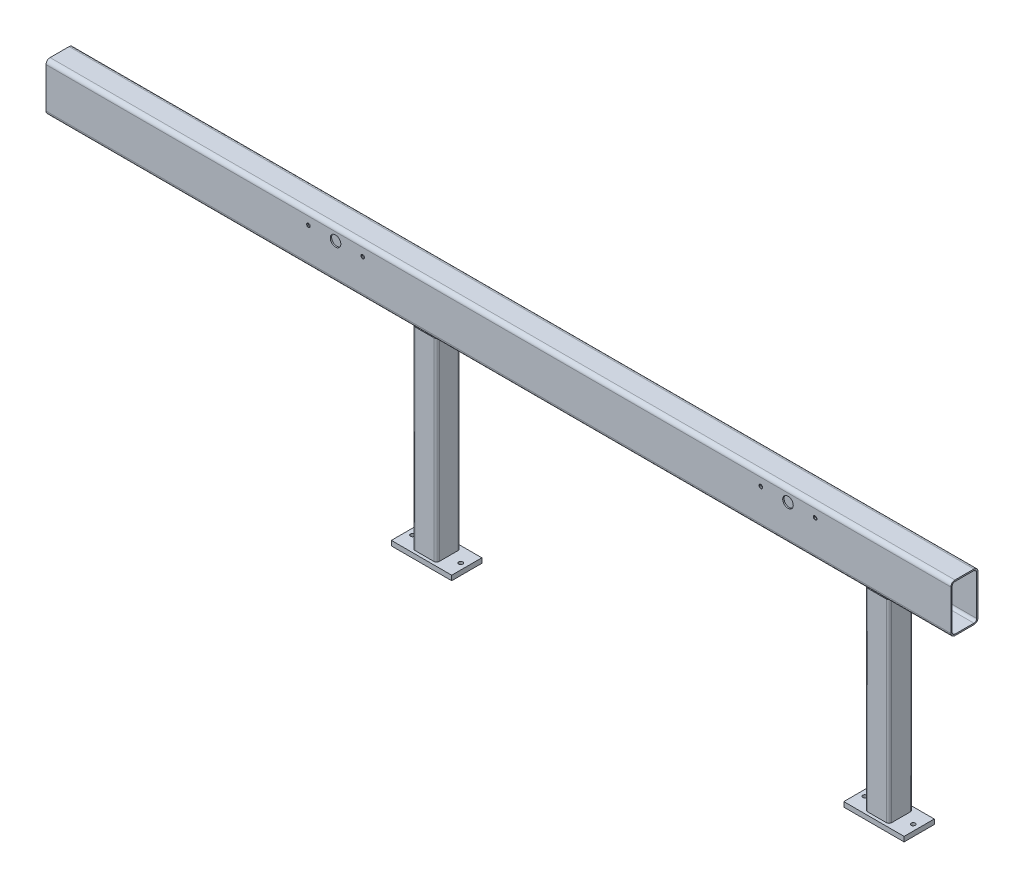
from build123d import *

# Parameters (mm, degrees)
STRUKTURBAUTEIL1_DEPTH                      = 3000
STRUKTURBAUTEIL2_DEPTH                      = 730
STRUKTURBAUTEIL2_2_DEPTH                    = 730
SKIZZE1571_W                                = 100
SKIZZE1571_H                                = 16
STRUKTURBAUTEIL3_DEPTH                      = 200
SKIZZE1571_ON_SEGMENT_2_W                   = 100
SKIZZE1571_ON_SEGMENT_2_H                   = 16
STRUKTURBAUTEIL3_2_DEPTH                    = 200
SKIZZE12_R                                  = 17.5
SCHNITT_LINEAR_AUSTRAGEN1_DEPTH             = 3091.901001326
M12_GEWINDEBOHRUNG1_AT_2_COUNT              = 2
M12_GEWINDEBOHRUNG1_AT_2_PITCH              = 180
SKIZZE145_W                                 = 6.75
SKIZZE145_H                                 = 16
F_13_5_13_5_DURCHMESSER_BOHRUNG1_AT_2_COUNT = 2
F_13_5_13_5_DURCHMESSER_BOHRUNG1_AT_2_PITCH = 160
LINEARES_MUSTER1_COUNT                      = 2
LINEARES_MUSTER1_PITCH                      = 1500
LINEARES_MUSTER1_COPY_2_SKETCH_W            = 6.75
LINEARES_MUSTER1_COPY_2_SKETCH_H            = 16


with BuildPart() as part:
    # Skizze155 → Strukturbauteil1 (new body)
    with BuildSketch(Plane(origin=(-3000, 0, 0), x_dir=(0, 0, 1), z_dir=(1, 0, 0))):
        with BuildLine():
            Line((-31.5, 80), (31.5, 80))
            ThreePointArc((31.5, 80), (41.045941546, 76.045941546), (45, 66.5))
            Line((45, 66.5), (45, -66.5))
            ThreePointArc((45, -66.5), (41.045941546, -76.045941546), (31.5, -80))
            Line((31.5, -80), (-31.5, -80))
            ThreePointArc((-31.5, -80), (-41.045941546, -76.045941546), (-45, -66.5))
            Line((-45, -66.5), (-45, 66.5))
            ThreePointArc((-45, 66.5), (-41.045941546, 76.045941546), (-31.5, 80))
        make_face()
        with BuildLine():
            Line((-31.5, 75.5), (31.5, 75.5))
            ThreePointArc((31.5, 75.5), (37.863961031, 72.863961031), (40.5, 66.5))
            Line((40.5, 66.5), (40.5, -66.5))
            ThreePointArc((40.5, -66.5), (37.863961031, -72.863961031), (31.5, -75.5))
            Line((31.5, -75.5), (-31.5, -75.5))
            ThreePointArc((-31.5, -75.5), (-37.863961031, -72.863961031), (-40.5, -66.5))
            Line((-40.5, -66.5), (-40.5, 66.5))
            ThreePointArc((-40.5, 66.5), (-37.863961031, 72.863961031), (-31.5, 75.5))
        make_face(mode=Mode.SUBTRACT)
    extrude(amount=STRUKTURBAUTEIL1_DEPTH)

    # Skizze12 → Schnitt-Linear austragen1 (cut, through all)
    with BuildSketch(Plane.XY.offset(45)):
        with Locations(Location((-540, 40, 0), (0, 0, 270))):
            Circle(SKIZZE12_R)
    schnitt_linear_austragen1 = extrude(amount=-SCHNITT_LINEAR_AUSTRAGEN1_DEPTH, mode=Mode.SUBTRACT)

    # Skizze157 → M12 Gewindebohrung1 (revolve, cut)
    with BuildSketch(Plane(origin=(-450, 40, 45), x_dir=(0, -1, 0), z_dir=(1, 0, 0))):
        Polygon((0, 0), (0, 95), (5.1, 95), (5.1, 0.925), (6.025, 0), align=None)
    m12_gewindebohrung1 = revolve(axis=Axis((-450, 40, 51.35), (0, 0, -1)), mode=Mode.SUBTRACT)

    # M12 Gewindebohrung1 at 2: M12 Gewindebohrung1 ×2
    with Locations(*[(-i * M12_GEWINDEBOHRUNG1_AT_2_PITCH, 0, 0) for i in range(1, M12_GEWINDEBOHRUNG1_AT_2_COUNT)]):
        add(m12_gewindebohrung1, mode=Mode.SUBTRACT)


with BuildPart() as body_2:
    # Skizze156 → Strukturbauteil2 (new body)
    with BuildSketch(Plane(origin=(-250, -730, 0), x_dir=(-1, 0, 0), z_dir=(0, 1, 0))):
        with BuildLine():
            Line((-31, 40), (31, 40))
            ThreePointArc((31, 40), (37.363961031, 37.363961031), (40, 31))
            Line((40, 31), (40, -31))
            ThreePointArc((40, -31), (37.363961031, -37.363961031), (31, -40))
            Line((31, -40), (-31, -40))
            ThreePointArc((-31, -40), (-37.363961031, -37.363961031), (-40, -31))
            Line((-40, -31), (-40, 31))
            ThreePointArc((-40, 31), (-37.363961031, 37.363961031), (-31, 40))
        make_face()
        with BuildLine():
            Line((-31, 36.4), (31, 36.4))
            ThreePointArc((31, 36.4), (34.818376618, 34.818376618), (36.4, 31))
            Line((36.4, 31), (36.4, -31))
            ThreePointArc((36.4, -31), (34.818376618, -34.818376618), (31, -36.4))
            Line((31, -36.4), (-31, -36.4))
            ThreePointArc((-31, -36.4), (-34.818376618, -34.818376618), (-36.4, -31))
            Line((-36.4, -31), (-36.4, 31))
            ThreePointArc((-36.4, 31), (-34.818376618, 34.818376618), (-31, 36.4))
        make_face(mode=Mode.SUBTRACT)
    extrude(amount=STRUKTURBAUTEIL2_DEPTH)

    # Trimmen_Verl_ngern1 43
    split(bisect_by=Plane.XZ.offset(80), keep=Keep.TOP)

    # Trimmen_Verl_ngern1 46
    split(bisect_by=Plane(origin=(-250, -722, 0), x_dir=(-1, 0, 0), z_dir=(0, 1, 0)), keep=Keep.TOP)


with BuildPart() as body_3:
    # Skizze156 on segment 2 (on carried to segment 2) → Strukturbauteil2 2 (new body)
    with BuildSketch(Plane(origin=(-1750, -730, 0), x_dir=(-1, 0, 0), z_dir=(0, 1, 0))):
        with BuildLine():
            Line((-31, 40), (31, 40))
            ThreePointArc((31, 40), (37.363961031, 37.363961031), (40, 31))
            Line((40, 31), (40, -31))
            ThreePointArc((40, -31), (37.363961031, -37.363961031), (31, -40))
            Line((31, -40), (-31, -40))
            ThreePointArc((-31, -40), (-37.363961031, -37.363961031), (-40, -31))
            Line((-40, -31), (-40, 31))
            ThreePointArc((-40, 31), (-37.363961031, 37.363961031), (-31, 40))
        make_face()
        with BuildLine():
            Line((-31, 36.4), (31, 36.4))
            ThreePointArc((31, 36.4), (34.818376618, 34.818376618), (36.4, 31))
            Line((36.4, 31), (36.4, -31))
            ThreePointArc((36.4, -31), (34.818376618, -34.818376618), (31, -36.4))
            Line((31, -36.4), (-31, -36.4))
            ThreePointArc((-31, -36.4), (-34.818376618, -34.818376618), (-36.4, -31))
            Line((-36.4, -31), (-36.4, 31))
            ThreePointArc((-36.4, 31), (-34.818376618, 34.818376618), (-31, 36.4))
        make_face(mode=Mode.SUBTRACT)
    extrude(amount=STRUKTURBAUTEIL2_2_DEPTH)

    # Trimmen_Verl_ngern1 11
    split(bisect_by=Plane(origin=(-1500, -80, 0), x_dir=(1, 0, 0), z_dir=(0, -1, 0)), keep=Keep.TOP)

    # Trimmen_Verl_ngern1 46
    split(bisect_by=Plane(origin=(-250, -722, 0), x_dir=(-1, 0, 0), z_dir=(0, 1, 0)), keep=Keep.TOP)


with BuildPart() as body_4:
    # Skizze1571 → Strukturbauteil3 (new body)
    with BuildSketch(Plane(origin=(-350, -730, 0), x_dir=(0, 0, 1), z_dir=(1, 0, 0))):
        Rectangle(SKIZZE1571_W, SKIZZE1571_H)
    extrude(amount=STRUKTURBAUTEIL3_DEPTH)

    # Skizze145 → 13.5 _13.5_ Durchmesser Bohrung1 (revolve, cut)
    with BuildSketch(Plane(origin=(-330, -738, 0), x_dir=(0, 0, -1), z_dir=(1, 0, 0))):
        with Locations((3.375, 8)):
            Rectangle(SKIZZE145_W, SKIZZE145_H)
    f_13_5_13_5_durchmesser_bohrung1 = revolve(axis=Axis((-330, -744.35, 0), (0, 1, 0)), mode=Mode.SUBTRACT)

    # 13.5 _13.5_ Durchmesser Bohrung1 at 2: 13.5 _13.5_ Durchmesser Bohrung1 ×2
    with Locations(*[(i * F_13_5_13_5_DURCHMESSER_BOHRUNG1_AT_2_PITCH, 0, 0) for i in range(1, F_13_5_13_5_DURCHMESSER_BOHRUNG1_AT_2_COUNT)]):
        add(f_13_5_13_5_durchmesser_bohrung1, mode=Mode.SUBTRACT)


with BuildPart() as body_5:
    # Skizze1571 on segment 2 (on carried to segment 2) → Strukturbauteil3 2 (new body)
    with BuildSketch(Plane(origin=(-1850, -730, 0), x_dir=(0, 0, 1), z_dir=(1, 0, 0))):
        Rectangle(SKIZZE1571_ON_SEGMENT_2_W, SKIZZE1571_ON_SEGMENT_2_H)
    extrude(amount=STRUKTURBAUTEIL3_2_DEPTH)


with BuildPart() as lineares_muster1_tool:
    # Lineares Muster1: Schnitt-Linear austragen1, M12 Gewindebohrung1, 13.5 _13.5_ Durchmesser Bohrung1 ×2
    with Locations(*[(-i * LINEARES_MUSTER1_PITCH, 0, 0) for i in range(1, LINEARES_MUSTER1_COUNT)]):
        add(schnitt_linear_austragen1)
        add(m12_gewindebohrung1)
        add(f_13_5_13_5_durchmesser_bohrung1)


with BuildPart() as part_1:
    add(part.part)

    # Lineares Muster1: cut by lineares_muster1_tool
    add(lineares_muster1_tool.part, mode=Mode.SUBTRACT)

    # Lineares Muster1 copy 1 sketch → Lineares Muster1 copy 1 (revolve, cut)
    with BuildSketch(Plane(origin=(-2130, 40, 45), x_dir=(0, -1, 0), z_dir=(1, 0, 0))):
        Polygon((0, 0), (0, 95), (5.1, 95), (5.1, 0.925), (6.025, 0), align=None)
    revolve(axis=Axis((-2130, 40, 51.35), (0, 0, -1)), mode=Mode.SUBTRACT)


with BuildPart() as body_5_1:
    add(body_5.part)

    # Lineares Muster1: cut by lineares_muster1_tool
    add(lineares_muster1_tool.part, mode=Mode.SUBTRACT)

    # Lineares Muster1 copy 2 sketch → Lineares Muster1 copy 2 (revolve, cut)
    with BuildSketch(Plane(origin=(-1670, -738, 0), x_dir=(0, 0, -1), z_dir=(1, 0, 0))):
        with Locations((3.375, 8)):
            Rectangle(LINEARES_MUSTER1_COPY_2_SKETCH_W, LINEARES_MUSTER1_COPY_2_SKETCH_H)
    revolve(axis=Axis((-1670, -744.35, 0), (0, 1, 0)), mode=Mode.SUBTRACT)


solid = Compound([body_2.part, body_3.part, body_4.part, part_1.part, body_5_1.part])
